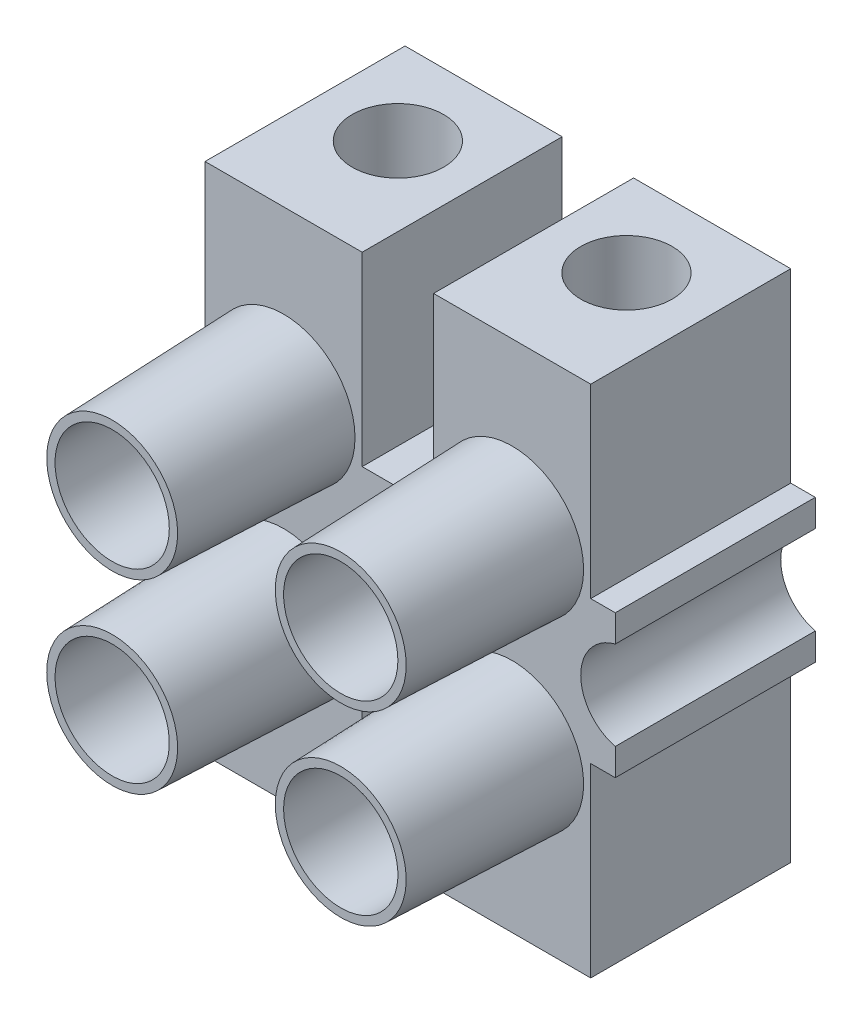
ISO-10303-21;
HEADER;
FILE_DESCRIPTION(('STEP AP214'),'2;1');
FILE_NAME('part.step','',(''),(''),'','','');
FILE_SCHEMA(('AUTOMOTIVE_DESIGN { 1 0 10303 214 1 1 1 1 }'));
ENDSEC;
DATA;
#1=APPLICATION_CONTEXT('core data for automotive mechanical design processes');
#2=APPLICATION_PROTOCOL_DEFINITION('international standard','automotive_design',2000,#1);
#3=PRODUCT_CONTEXT('',#1,'mechanical');
#4=PRODUCT('Part','Part','',(#3));
#5=PRODUCT_RELATED_PRODUCT_CATEGORY('part','',(#4));
#6=PRODUCT_DEFINITION_FORMATION('','',#4);
#7=PRODUCT_DEFINITION_CONTEXT('part definition',#1,'design');
#8=PRODUCT_DEFINITION('design','',#6,#7);
#9=PRODUCT_DEFINITION_SHAPE('','',#8);
#10=(LENGTH_UNIT() NAMED_UNIT(*) SI_UNIT(.MILLI.,.METRE.));
#11=(NAMED_UNIT(*) PLANE_ANGLE_UNIT() SI_UNIT($,.RADIAN.));
#12=(NAMED_UNIT(*) SI_UNIT($,.STERADIAN.) SOLID_ANGLE_UNIT());
#13=UNCERTAINTY_MEASURE_WITH_UNIT(LENGTH_MEASURE(1.E-05),#10,'distance_accuracy_value','');
#14=(GEOMETRIC_REPRESENTATION_CONTEXT(3) GLOBAL_UNCERTAINTY_ASSIGNED_CONTEXT((#13)) GLOBAL_UNIT_ASSIGNED_CONTEXT((#10,
#11,#12)) REPRESENTATION_CONTEXT('',''));
#15=CARTESIAN_POINT('',(0.,0.,0.));
#16=DIRECTION('',(0.,0.,1.));
#17=DIRECTION('',(1.,0.,0.));
#18=AXIS2_PLACEMENT_3D('',#15,#16,#17);
#19=CARTESIAN_POINT('',(14.75,0.,7.));
#20=DIRECTION('',(0.,0.,1.));
#21=DIRECTION('',(1.,0.,0.));
#22=AXIS2_PLACEMENT_3D('',#19,#20,#21);
#23=PLANE('',#22);
#24=DIRECTION('',(0.,-1.,0.));
#25=VECTOR('',#24,1.);
#26=CARTESIAN_POINT('',(0.,2.5,7.));
#27=LINE('',#26,#25);
#28=CARTESIAN_POINT('',(0.,9.,7.));
#29=VERTEX_POINT('',#28);
#30=CARTESIAN_POINT('',(0.,-9.,7.));
#31=VERTEX_POINT('',#30);
#32=EDGE_CURVE('E43',#29,#31,#27,.T.);
#33=ORIENTED_EDGE('',*,*,#32,.T.);
#34=DIRECTION('',(1.,0.,0.));
#35=VECTOR('',#34,1.);
#36=CARTESIAN_POINT('',(0.,-9.,7.));
#37=LINE('',#36,#35);
#38=CARTESIAN_POINT('',(5.5,-9.,7.));
#39=VERTEX_POINT('',#38);
#40=EDGE_CURVE('E169',#31,#39,#37,.T.);
#41=ORIENTED_EDGE('',*,*,#40,.T.);
#42=DIRECTION('',(0.,1.,0.));
#43=VECTOR('',#42,1.);
#44=CARTESIAN_POINT('',(5.5,-9.,7.));
#45=LINE('',#44,#43);
#46=CARTESIAN_POINT('',(5.5,-2.5,7.));
#47=VERTEX_POINT('',#46);
#48=EDGE_CURVE('E217',#39,#47,#45,.T.);
#49=ORIENTED_EDGE('',*,*,#48,.T.);
#50=DIRECTION('',(1.,0.,0.));
#51=VECTOR('',#50,1.);
#52=CARTESIAN_POINT('',(5.5,-2.5,7.));
#53=LINE('',#52,#51);
#54=CARTESIAN_POINT('',(8.,-2.5,7.));
#55=VERTEX_POINT('',#54);
#56=EDGE_CURVE('E219',#47,#55,#53,.T.);
#57=ORIENTED_EDGE('',*,*,#56,.T.);
#58=DIRECTION('',(0.,-1.,0.));
#59=VECTOR('',#58,1.);
#60=CARTESIAN_POINT('',(8.,-2.5,7.));
#61=LINE('',#60,#59);
#62=CARTESIAN_POINT('',(8.,-9.,7.));
#63=VERTEX_POINT('',#62);
#64=EDGE_CURVE('E221',#55,#63,#61,.T.);
#65=ORIENTED_EDGE('',*,*,#64,.T.);
#66=DIRECTION('',(1.,0.,0.));
#67=VECTOR('',#66,1.);
#68=CARTESIAN_POINT('',(8.,-9.,7.));
#69=LINE('',#68,#67);
#70=CARTESIAN_POINT('',(13.5,-9.,7.));
#71=VERTEX_POINT('',#70);
#72=EDGE_CURVE('E223',#63,#71,#69,.T.);
#73=ORIENTED_EDGE('',*,*,#72,.T.);
#74=DIRECTION('',(0.,1.,0.));
#75=VECTOR('',#74,1.);
#76=CARTESIAN_POINT('',(13.5,-9.,7.));
#77=LINE('',#76,#75);
#78=CARTESIAN_POINT('',(13.5,-2.5,7.));
#79=VERTEX_POINT('',#78);
#80=EDGE_CURVE('E225',#71,#79,#77,.T.);
#81=ORIENTED_EDGE('',*,*,#80,.T.);
#82=DIRECTION('',(1.,0.,0.));
#83=VECTOR('',#82,1.);
#84=CARTESIAN_POINT('',(13.5,-2.5,7.));
#85=LINE('',#84,#83);
#86=CARTESIAN_POINT('',(14.3588170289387,-2.5,7.));
#87=VERTEX_POINT('',#86);
#88=EDGE_CURVE('E227',#79,#87,#85,.T.);
#89=ORIENTED_EDGE('',*,*,#88,.T.);
#90=DIRECTION('',(0.,1.,0.));
#91=VECTOR('',#90,1.);
#92=CARTESIAN_POINT('',(14.3588170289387,-1.5514431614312,7.));
#93=LINE('',#92,#91);
#94=CARTESIAN_POINT('',(14.3588170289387,-1.5514431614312,7.));
#95=VERTEX_POINT('',#94);
#96=EDGE_CURVE('E229',#87,#95,#93,.T.);
#97=ORIENTED_EDGE('',*,*,#96,.T.);
#98=CARTESIAN_POINT('',(14.75,0.,7.));
#99=DIRECTION('',(0.,0.,-1.));
#100=DIRECTION('',(1.,0.,0.));
#101=AXIS2_PLACEMENT_3D('',#98,#99,#100);
#102=CIRCLE('',#101,1.6);
#103=CARTESIAN_POINT('',(14.3588170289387,1.5514431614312,7.));
#104=VERTEX_POINT('',#103);
#105=EDGE_CURVE('E231',#95,#104,#102,.T.);
#106=ORIENTED_EDGE('',*,*,#105,.T.);
#107=DIRECTION('',(0.,1.,0.));
#108=VECTOR('',#107,1.);
#109=CARTESIAN_POINT('',(14.3588170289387,2.5,7.));
#110=LINE('',#109,#108);
#111=CARTESIAN_POINT('',(14.3588170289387,2.5,7.));
#112=VERTEX_POINT('',#111);
#113=EDGE_CURVE('E233',#104,#112,#110,.T.);
#114=ORIENTED_EDGE('',*,*,#113,.T.);
#115=DIRECTION('',(-1.,0.,0.));
#116=VECTOR('',#115,1.);
#117=CARTESIAN_POINT('',(13.5,2.5,7.));
#118=LINE('',#117,#116);
#119=CARTESIAN_POINT('',(13.5,2.5,7.));
#120=VERTEX_POINT('',#119);
#121=EDGE_CURVE('E235',#112,#120,#118,.T.);
#122=ORIENTED_EDGE('',*,*,#121,.T.);
#123=DIRECTION('',(0.,1.,0.));
#124=VECTOR('',#123,1.);
#125=CARTESIAN_POINT('',(13.5,9.,7.));
#126=LINE('',#125,#124);
#127=CARTESIAN_POINT('',(13.5,9.,7.));
#128=VERTEX_POINT('',#127);
#129=EDGE_CURVE('E237',#120,#128,#126,.T.);
#130=ORIENTED_EDGE('',*,*,#129,.T.);
#131=DIRECTION('',(-1.,0.,0.));
#132=VECTOR('',#131,1.);
#133=CARTESIAN_POINT('',(8.,9.,7.));
#134=LINE('',#133,#132);
#135=CARTESIAN_POINT('',(8.,9.,7.));
#136=VERTEX_POINT('',#135);
#137=EDGE_CURVE('E239',#128,#136,#134,.T.);
#138=ORIENTED_EDGE('',*,*,#137,.T.);
#139=DIRECTION('',(0.,-1.,0.));
#140=VECTOR('',#139,1.);
#141=CARTESIAN_POINT('',(8.,2.5,7.));
#142=LINE('',#141,#140);
#143=CARTESIAN_POINT('',(8.,2.5,7.));
#144=VERTEX_POINT('',#143);
#145=EDGE_CURVE('E241',#136,#144,#142,.T.);
#146=ORIENTED_EDGE('',*,*,#145,.T.);
#147=DIRECTION('',(-1.,0.,0.));
#148=VECTOR('',#147,1.);
#149=CARTESIAN_POINT('',(5.5,2.5,7.));
#150=LINE('',#149,#148);
#151=CARTESIAN_POINT('',(5.5,2.5,7.));
#152=VERTEX_POINT('',#151);
#153=EDGE_CURVE('E243',#144,#152,#150,.T.);
#154=ORIENTED_EDGE('',*,*,#153,.T.);
#155=DIRECTION('',(0.,1.,0.));
#156=VECTOR('',#155,1.);
#157=CARTESIAN_POINT('',(5.5,9.,7.));
#158=LINE('',#157,#156);
#159=CARTESIAN_POINT('',(5.5,9.,7.));
#160=VERTEX_POINT('',#159);
#161=EDGE_CURVE('E50',#152,#160,#158,.T.);
#162=ORIENTED_EDGE('',*,*,#161,.T.);
#163=DIRECTION('',(-1.,0.,0.));
#164=VECTOR('',#163,1.);
#165=CARTESIAN_POINT('',(0.,9.,7.));
#166=LINE('',#165,#164);
#167=EDGE_CURVE('E246',#160,#29,#166,.T.);
#168=ORIENTED_EDGE('',*,*,#167,.T.);
#169=EDGE_LOOP('',(#33,#41,#49,#57,#65,#73,#81,#89,#97,#106,#114,#122,#130,#138,#146,#154,#162,#168));
#170=FACE_BOUND('',#169,.T.);
#171=CARTESIAN_POINT('',(6.75,0.,7.));
#172=DIRECTION('',(0.,0.,1.));
#173=DIRECTION('',(1.,0.,0.));
#174=AXIS2_PLACEMENT_3D('',#171,#172,#173);
#175=CIRCLE('',#174,1.6);
#176=CARTESIAN_POINT('',(8.35,0.,7.));
#177=VERTEX_POINT('',#176);
#178=EDGE_CURVE('E178',#177,#177,#175,.T.);
#179=ORIENTED_EDGE('',*,*,#178,.F.);
#180=EDGE_LOOP('',(#179));
#181=FACE_BOUND('',#180,.T.);
#182=CARTESIAN_POINT('',(2.75,3.25,7.));
#183=DIRECTION('',(0.,0.,1.));
#184=DIRECTION('',(1.,0.,0.));
#185=AXIS2_PLACEMENT_3D('',#182,#183,#184);
#186=CIRCLE('',#185,2.5);
#187=CARTESIAN_POINT('',(5.25,3.25,7.));
#188=VERTEX_POINT('',#187);
#189=EDGE_CURVE('E305',#188,#188,#186,.T.);
#190=ORIENTED_EDGE('',*,*,#189,.F.);
#191=EDGE_LOOP('',(#190));
#192=FACE_BOUND('',#191,.T.);
#193=CARTESIAN_POINT('',(10.75,3.25,7.));
#194=DIRECTION('',(0.,0.,1.));
#195=DIRECTION('',(1.,0.,0.));
#196=AXIS2_PLACEMENT_3D('',#193,#194,#195);
#197=CIRCLE('',#196,2.5);
#198=CARTESIAN_POINT('',(13.25,3.25,7.));
#199=VERTEX_POINT('',#198);
#200=EDGE_CURVE('E313',#199,#199,#197,.T.);
#201=ORIENTED_EDGE('',*,*,#200,.F.);
#202=EDGE_LOOP('',(#201));
#203=FACE_BOUND('',#202,.T.);
#204=CARTESIAN_POINT('',(10.75,-3.25,7.));
#205=DIRECTION('',(0.,0.,1.));
#206=DIRECTION('',(-1.,0.,0.));
#207=AXIS2_PLACEMENT_3D('',#204,#205,#206);
#208=CIRCLE('',#207,2.5);
#209=CARTESIAN_POINT('',(8.25,-3.25,7.));
#210=VERTEX_POINT('',#209);
#211=EDGE_CURVE('E309',#210,#210,#208,.T.);
#212=ORIENTED_EDGE('',*,*,#211,.F.);
#213=EDGE_LOOP('',(#212));
#214=FACE_BOUND('',#213,.T.);
#215=CARTESIAN_POINT('',(2.75,-3.25,7.));
#216=DIRECTION('',(0.,0.,1.));
#217=DIRECTION('',(-1.,0.,0.));
#218=AXIS2_PLACEMENT_3D('',#215,#216,#217);
#219=CIRCLE('',#218,2.5);
#220=CARTESIAN_POINT('',(0.249999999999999,-3.25,7.));
#221=VERTEX_POINT('',#220);
#222=EDGE_CURVE('E437',#221,#221,#219,.T.);
#223=ORIENTED_EDGE('',*,*,#222,.F.);
#224=EDGE_LOOP('',(#223));
#225=FACE_BOUND('',#224,.T.);
#226=ADVANCED_FACE('F26',(#170,#181,#192,#203,#214,#225),#23,.T.);
#227=CARTESIAN_POINT('',(14.75,0.,0.));
#228=DIRECTION('',(0.,0.,1.));
#229=DIRECTION('',(1.,0.,0.));
#230=AXIS2_PLACEMENT_3D('',#227,#228,#229);
#231=PLANE('',#230);
#232=DIRECTION('',(1.,0.,0.));
#233=VECTOR('',#232,1.);
#234=CARTESIAN_POINT('',(0.,-9.,0.));
#235=LINE('',#234,#233);
#236=CARTESIAN_POINT('',(0.,-9.,0.));
#237=VERTEX_POINT('',#236);
#238=CARTESIAN_POINT('',(5.5,-9.,0.));
#239=VERTEX_POINT('',#238);
#240=EDGE_CURVE('E167',#237,#239,#235,.T.);
#241=ORIENTED_EDGE('',*,*,#240,.F.);
#242=DIRECTION('',(0.,-1.,0.));
#243=VECTOR('',#242,1.);
#244=CARTESIAN_POINT('',(0.,2.5,0.));
#245=LINE('',#244,#243);
#246=CARTESIAN_POINT('',(0.,9.,0.));
#247=VERTEX_POINT('',#246);
#248=EDGE_CURVE('E152',#247,#237,#245,.T.);
#249=ORIENTED_EDGE('',*,*,#248,.F.);
#250=DIRECTION('',(-1.,0.,0.));
#251=VECTOR('',#250,1.);
#252=CARTESIAN_POINT('',(0.,9.,0.));
#253=LINE('',#252,#251);
#254=CARTESIAN_POINT('',(5.5,9.,0.));
#255=VERTEX_POINT('',#254);
#256=EDGE_CURVE('E162',#255,#247,#253,.T.);
#257=ORIENTED_EDGE('',*,*,#256,.F.);
#258=DIRECTION('',(0.,1.,0.));
#259=VECTOR('',#258,1.);
#260=CARTESIAN_POINT('',(5.5,9.,0.));
#261=LINE('',#260,#259);
#262=CARTESIAN_POINT('',(5.5,2.5,0.));
#263=VERTEX_POINT('',#262);
#264=EDGE_CURVE('E212',#263,#255,#261,.T.);
#265=ORIENTED_EDGE('',*,*,#264,.F.);
#266=DIRECTION('',(-1.,0.,0.));
#267=VECTOR('',#266,1.);
#268=CARTESIAN_POINT('',(5.5,2.5,0.));
#269=LINE('',#268,#267);
#270=CARTESIAN_POINT('',(8.,2.5,0.));
#271=VERTEX_POINT('',#270);
#272=EDGE_CURVE('E210',#271,#263,#269,.T.);
#273=ORIENTED_EDGE('',*,*,#272,.F.);
#274=DIRECTION('',(0.,-1.,0.));
#275=VECTOR('',#274,1.);
#276=CARTESIAN_POINT('',(8.,2.5,0.));
#277=LINE('',#276,#275);
#278=CARTESIAN_POINT('',(8.,9.,0.));
#279=VERTEX_POINT('',#278);
#280=EDGE_CURVE('E208',#279,#271,#277,.T.);
#281=ORIENTED_EDGE('',*,*,#280,.F.);
#282=DIRECTION('',(-1.,0.,0.));
#283=VECTOR('',#282,1.);
#284=CARTESIAN_POINT('',(8.,9.,0.));
#285=LINE('',#284,#283);
#286=CARTESIAN_POINT('',(13.5,9.,0.));
#287=VERTEX_POINT('',#286);
#288=EDGE_CURVE('E206',#287,#279,#285,.T.);
#289=ORIENTED_EDGE('',*,*,#288,.F.);
#290=DIRECTION('',(0.,1.,0.));
#291=VECTOR('',#290,1.);
#292=CARTESIAN_POINT('',(13.5,9.,0.));
#293=LINE('',#292,#291);
#294=CARTESIAN_POINT('',(13.5,2.5,0.));
#295=VERTEX_POINT('',#294);
#296=EDGE_CURVE('E204',#295,#287,#293,.T.);
#297=ORIENTED_EDGE('',*,*,#296,.F.);
#298=DIRECTION('',(-1.,0.,0.));
#299=VECTOR('',#298,1.);
#300=CARTESIAN_POINT('',(13.5,2.5,0.));
#301=LINE('',#300,#299);
#302=CARTESIAN_POINT('',(14.3588170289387,2.5,0.));
#303=VERTEX_POINT('',#302);
#304=EDGE_CURVE('E202',#303,#295,#301,.T.);
#305=ORIENTED_EDGE('',*,*,#304,.F.);
#306=DIRECTION('',(0.,1.,0.));
#307=VECTOR('',#306,1.);
#308=CARTESIAN_POINT('',(14.3588170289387,2.5,0.));
#309=LINE('',#308,#307);
#310=CARTESIAN_POINT('',(14.3588170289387,1.5514431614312,0.));
#311=VERTEX_POINT('',#310);
#312=EDGE_CURVE('E200',#311,#303,#309,.T.);
#313=ORIENTED_EDGE('',*,*,#312,.F.);
#314=CARTESIAN_POINT('',(14.75,0.,0.));
#315=DIRECTION('',(0.,0.,-1.));
#316=DIRECTION('',(1.,0.,0.));
#317=AXIS2_PLACEMENT_3D('',#314,#315,#316);
#318=CIRCLE('',#317,1.6);
#319=CARTESIAN_POINT('',(14.3588170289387,-1.5514431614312,0.));
#320=VERTEX_POINT('',#319);
#321=EDGE_CURVE('E198',#320,#311,#318,.T.);
#322=ORIENTED_EDGE('',*,*,#321,.F.);
#323=DIRECTION('',(0.,1.,0.));
#324=VECTOR('',#323,1.);
#325=CARTESIAN_POINT('',(14.3588170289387,-1.5514431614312,0.));
#326=LINE('',#325,#324);
#327=CARTESIAN_POINT('',(14.3588170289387,-2.5,0.));
#328=VERTEX_POINT('',#327);
#329=EDGE_CURVE('E196',#328,#320,#326,.T.);
#330=ORIENTED_EDGE('',*,*,#329,.F.);
#331=DIRECTION('',(1.,0.,0.));
#332=VECTOR('',#331,1.);
#333=CARTESIAN_POINT('',(13.5,-2.5,0.));
#334=LINE('',#333,#332);
#335=CARTESIAN_POINT('',(13.5,-2.5,0.));
#336=VERTEX_POINT('',#335);
#337=EDGE_CURVE('E194',#336,#328,#334,.T.);
#338=ORIENTED_EDGE('',*,*,#337,.F.);
#339=DIRECTION('',(0.,1.,0.));
#340=VECTOR('',#339,1.);
#341=CARTESIAN_POINT('',(13.5,-9.,0.));
#342=LINE('',#341,#340);
#343=CARTESIAN_POINT('',(13.5,-9.,0.));
#344=VERTEX_POINT('',#343);
#345=EDGE_CURVE('E192',#344,#336,#342,.T.);
#346=ORIENTED_EDGE('',*,*,#345,.F.);
#347=DIRECTION('',(1.,0.,0.));
#348=VECTOR('',#347,1.);
#349=CARTESIAN_POINT('',(8.,-9.,0.));
#350=LINE('',#349,#348);
#351=CARTESIAN_POINT('',(8.,-9.,0.));
#352=VERTEX_POINT('',#351);
#353=EDGE_CURVE('E190',#352,#344,#350,.T.);
#354=ORIENTED_EDGE('',*,*,#353,.F.);
#355=DIRECTION('',(0.,-1.,0.));
#356=VECTOR('',#355,1.);
#357=CARTESIAN_POINT('',(8.,-2.5,0.));
#358=LINE('',#357,#356);
#359=CARTESIAN_POINT('',(8.,-2.5,0.));
#360=VERTEX_POINT('',#359);
#361=EDGE_CURVE('E188',#360,#352,#358,.T.);
#362=ORIENTED_EDGE('',*,*,#361,.F.);
#363=DIRECTION('',(1.,0.,0.));
#364=VECTOR('',#363,1.);
#365=CARTESIAN_POINT('',(5.5,-2.5,0.));
#366=LINE('',#365,#364);
#367=CARTESIAN_POINT('',(5.5,-2.5,0.));
#368=VERTEX_POINT('',#367);
#369=EDGE_CURVE('E180',#368,#360,#366,.T.);
#370=ORIENTED_EDGE('',*,*,#369,.F.);
#371=DIRECTION('',(0.,1.,0.));
#372=VECTOR('',#371,1.);
#373=CARTESIAN_POINT('',(5.5,-9.,0.));
#374=LINE('',#373,#372);
#375=EDGE_CURVE('E177',#239,#368,#374,.T.);
#376=ORIENTED_EDGE('',*,*,#375,.F.);
#377=EDGE_LOOP('',(#241,#249,#257,#265,#273,#281,#289,#297,#305,#313,#322,#330,#338,#346,#354,
#362,#370,#376));
#378=FACE_BOUND('',#377,.T.);
#379=CARTESIAN_POINT('',(6.75,0.,0.));
#380=DIRECTION('',(0.,0.,1.));
#381=DIRECTION('',(1.,0.,0.));
#382=AXIS2_PLACEMENT_3D('',#379,#380,#381);
#383=CIRCLE('',#382,1.6);
#384=CARTESIAN_POINT('',(8.35,0.,0.));
#385=VERTEX_POINT('',#384);
#386=EDGE_CURVE('E183',#385,#385,#383,.T.);
#387=ORIENTED_EDGE('',*,*,#386,.T.);
#388=EDGE_LOOP('',(#387));
#389=FACE_BOUND('',#388,.T.);
#390=ADVANCED_FACE('F174',(#378,#389),#231,.F.);
#391=CARTESIAN_POINT('',(0.,-9.,7.));
#392=DIRECTION('',(0.,1.,0.));
#393=DIRECTION('',(0.,0.,1.));
#394=AXIS2_PLACEMENT_3D('',#391,#392,#393);
#395=PLANE('',#394);
#396=CARTESIAN_POINT('',(2.75,-9.,3.));
#397=DIRECTION('',(0.,-1.,0.));
#398=DIRECTION('',(0.,0.,-1.));
#399=AXIS2_PLACEMENT_3D('',#396,#397,#398);
#400=CIRCLE('',#399,1.6);
#401=CARTESIAN_POINT('',(2.75,-9.,1.4));
#402=VERTEX_POINT('',#401);
#403=EDGE_CURVE('E426',#402,#402,#400,.T.);
#404=ORIENTED_EDGE('',*,*,#403,.F.);
#405=EDGE_LOOP('',(#404));
#406=FACE_BOUND('',#405,.T.);
#407=ORIENTED_EDGE('',*,*,#240,.T.);
#408=DIRECTION('',(0.,0.,-1.));
#409=VECTOR('',#408,1.);
#410=CARTESIAN_POINT('',(5.5,-9.,7.));
#411=LINE('',#410,#409);
#412=EDGE_CURVE('E171',#39,#239,#411,.T.);
#413=ORIENTED_EDGE('',*,*,#412,.F.);
#414=ORIENTED_EDGE('',*,*,#40,.F.);
#415=DIRECTION('',(0.,0.,-1.));
#416=VECTOR('',#415,1.);
#417=CARTESIAN_POINT('',(0.,-9.,7.));
#418=LINE('',#417,#416);
#419=EDGE_CURVE('E155',#31,#237,#418,.T.);
#420=ORIENTED_EDGE('',*,*,#419,.T.);
#421=EDGE_LOOP('',(#407,#413,#414,#420));
#422=FACE_BOUND('',#421,.T.);
#423=ADVANCED_FACE('F165',(#406,#422),#395,.F.);
#424=CARTESIAN_POINT('',(5.5,-9.,7.));
#425=DIRECTION('',(-1.,0.,0.));
#426=DIRECTION('',(0.,0.,1.));
#427=AXIS2_PLACEMENT_3D('',#424,#425,#426);
#428=PLANE('',#427);
#429=ORIENTED_EDGE('',*,*,#375,.T.);
#430=DIRECTION('',(0.,0.,-1.));
#431=VECTOR('',#430,1.);
#432=CARTESIAN_POINT('',(5.5,-2.5,7.));
#433=LINE('',#432,#431);
#434=EDGE_CURVE('E291',#47,#368,#433,.T.);
#435=ORIENTED_EDGE('',*,*,#434,.F.);
#436=ORIENTED_EDGE('',*,*,#48,.F.);
#437=ORIENTED_EDGE('',*,*,#412,.T.);
#438=EDGE_LOOP('',(#429,#435,#436,#437));
#439=FACE_BOUND('',#438,.T.);
#440=ADVANCED_FACE('F528',(#439),#428,.F.);
#441=CARTESIAN_POINT('',(5.5,-2.5,7.));
#442=DIRECTION('',(0.,1.,0.));
#443=DIRECTION('',(-1.,0.,0.));
#444=AXIS2_PLACEMENT_3D('',#441,#442,#443);
#445=PLANE('',#444);
#446=ORIENTED_EDGE('',*,*,#369,.T.);
#447=DIRECTION('',(0.,0.,-1.));
#448=VECTOR('',#447,1.);
#449=CARTESIAN_POINT('',(8.,-2.5,7.));
#450=LINE('',#449,#448);
#451=EDGE_CURVE('E288',#55,#360,#450,.T.);
#452=ORIENTED_EDGE('',*,*,#451,.F.);
#453=ORIENTED_EDGE('',*,*,#56,.F.);
#454=ORIENTED_EDGE('',*,*,#434,.T.);
#455=EDGE_LOOP('',(#446,#452,#453,#454));
#456=FACE_BOUND('',#455,.T.);
#457=ADVANCED_FACE('F651',(#456),#445,.F.);
#458=CARTESIAN_POINT('',(8.,-2.5,7.));
#459=DIRECTION('',(1.,0.,0.));
#460=DIRECTION('',(0.,0.,-1.));
#461=AXIS2_PLACEMENT_3D('',#458,#459,#460);
#462=PLANE('',#461);
#463=ORIENTED_EDGE('',*,*,#361,.T.);
#464=DIRECTION('',(0.,0.,-1.));
#465=VECTOR('',#464,1.);
#466=CARTESIAN_POINT('',(8.,-9.,7.));
#467=LINE('',#466,#465);
#468=EDGE_CURVE('E285',#63,#352,#467,.T.);
#469=ORIENTED_EDGE('',*,*,#468,.F.);
#470=ORIENTED_EDGE('',*,*,#64,.F.);
#471=ORIENTED_EDGE('',*,*,#451,.T.);
#472=EDGE_LOOP('',(#463,#469,#470,#471));
#473=FACE_BOUND('',#472,.T.);
#474=ADVANCED_FACE('F520',(#473),#462,.F.);
#475=CARTESIAN_POINT('',(8.,-9.,7.));
#476=DIRECTION('',(0.,1.,0.));
#477=DIRECTION('',(0.,0.,1.));
#478=AXIS2_PLACEMENT_3D('',#475,#476,#477);
#479=PLANE('',#478);
#480=CARTESIAN_POINT('',(10.75,-9.,3.));
#481=DIRECTION('',(0.,-1.,0.));
#482=DIRECTION('',(0.,0.,-1.));
#483=AXIS2_PLACEMENT_3D('',#480,#481,#482);
#484=CIRCLE('',#483,1.6);
#485=CARTESIAN_POINT('',(10.75,-9.,1.4));
#486=VERTEX_POINT('',#485);
#487=EDGE_CURVE('E423',#486,#486,#484,.T.);
#488=ORIENTED_EDGE('',*,*,#487,.F.);
#489=EDGE_LOOP('',(#488));
#490=FACE_BOUND('',#489,.T.);
#491=ORIENTED_EDGE('',*,*,#353,.T.);
#492=DIRECTION('',(0.,0.,-1.));
#493=VECTOR('',#492,1.);
#494=CARTESIAN_POINT('',(13.5,-9.,7.));
#495=LINE('',#494,#493);
#496=EDGE_CURVE('E282',#71,#344,#495,.T.);
#497=ORIENTED_EDGE('',*,*,#496,.F.);
#498=ORIENTED_EDGE('',*,*,#72,.F.);
#499=ORIENTED_EDGE('',*,*,#468,.T.);
#500=EDGE_LOOP('',(#491,#497,#498,#499));
#501=FACE_BOUND('',#500,.T.);
#502=ADVANCED_FACE('F515',(#490,#501),#479,.F.);
#503=CARTESIAN_POINT('',(13.5,-9.,7.));
#504=DIRECTION('',(-1.,0.,0.));
#505=DIRECTION('',(0.,0.,1.));
#506=AXIS2_PLACEMENT_3D('',#503,#504,#505);
#507=PLANE('',#506);
#508=ORIENTED_EDGE('',*,*,#345,.T.);
#509=DIRECTION('',(0.,0.,-1.));
#510=VECTOR('',#509,1.);
#511=CARTESIAN_POINT('',(13.5,-2.5,7.));
#512=LINE('',#511,#510);
#513=EDGE_CURVE('E279',#79,#336,#512,.T.);
#514=ORIENTED_EDGE('',*,*,#513,.F.);
#515=ORIENTED_EDGE('',*,*,#80,.F.);
#516=ORIENTED_EDGE('',*,*,#496,.T.);
#517=EDGE_LOOP('',(#508,#514,#515,#516));
#518=FACE_BOUND('',#517,.T.);
#519=ADVANCED_FACE('F519',(#518),#507,.F.);
#520=CARTESIAN_POINT('',(13.5,-2.5,7.));
#521=DIRECTION('',(0.,1.,0.));
#522=DIRECTION('',(0.,0.,1.));
#523=AXIS2_PLACEMENT_3D('',#520,#521,#522);
#524=PLANE('',#523);
#525=ORIENTED_EDGE('',*,*,#337,.T.);
#526=DIRECTION('',(0.,0.,-1.));
#527=VECTOR('',#526,1.);
#528=CARTESIAN_POINT('',(14.3588170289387,-2.5,7.));
#529=LINE('',#528,#527);
#530=EDGE_CURVE('E276',#87,#328,#529,.T.);
#531=ORIENTED_EDGE('',*,*,#530,.F.);
#532=ORIENTED_EDGE('',*,*,#88,.F.);
#533=ORIENTED_EDGE('',*,*,#513,.T.);
#534=EDGE_LOOP('',(#525,#531,#532,#533));
#535=FACE_BOUND('',#534,.T.);
#536=ADVANCED_FACE('F631',(#535),#524,.F.);
#537=CARTESIAN_POINT('',(14.3588170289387,-1.5514431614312,7.));
#538=DIRECTION('',(-1.,0.,0.));
#539=DIRECTION('',(0.,0.,1.));
#540=AXIS2_PLACEMENT_3D('',#537,#538,#539);
#541=PLANE('',#540);
#542=ORIENTED_EDGE('',*,*,#329,.T.);
#543=DIRECTION('',(0.,0.,-1.));
#544=VECTOR('',#543,1.);
#545=CARTESIAN_POINT('',(14.3588170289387,-1.5514431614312,7.));
#546=LINE('',#545,#544);
#547=EDGE_CURVE('E273',#95,#320,#546,.T.);
#548=ORIENTED_EDGE('',*,*,#547,.F.);
#549=ORIENTED_EDGE('',*,*,#96,.F.);
#550=ORIENTED_EDGE('',*,*,#530,.T.);
#551=EDGE_LOOP('',(#542,#548,#549,#550));
#552=FACE_BOUND('',#551,.T.);
#553=ADVANCED_FACE('F623',(#552),#541,.F.);
#554=CARTESIAN_POINT('',(14.75,0.,7.));
#555=DIRECTION('',(0.,0.,-1.));
#556=DIRECTION('',(-1.,0.,0.));
#557=AXIS2_PLACEMENT_3D('',#554,#555,#556);
#558=CYLINDRICAL_SURFACE('',#557,1.6);
#559=ORIENTED_EDGE('',*,*,#321,.T.);
#560=DIRECTION('',(0.,0.,-1.));
#561=VECTOR('',#560,1.);
#562=CARTESIAN_POINT('',(14.3588170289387,1.5514431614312,7.));
#563=LINE('',#562,#561);
#564=EDGE_CURVE('E270',#104,#311,#563,.T.);
#565=ORIENTED_EDGE('',*,*,#564,.F.);
#566=ORIENTED_EDGE('',*,*,#105,.F.);
#567=ORIENTED_EDGE('',*,*,#547,.T.);
#568=EDGE_LOOP('',(#559,#565,#566,#567));
#569=FACE_BOUND('',#568,.T.);
#570=ADVANCED_FACE('F615',(#569),#558,.F.);
#571=CARTESIAN_POINT('',(14.3588170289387,2.5,7.));
#572=DIRECTION('',(-1.,0.,0.));
#573=DIRECTION('',(0.,0.,1.));
#574=AXIS2_PLACEMENT_3D('',#571,#572,#573);
#575=PLANE('',#574);
#576=ORIENTED_EDGE('',*,*,#312,.T.);
#577=DIRECTION('',(0.,0.,-1.));
#578=VECTOR('',#577,1.);
#579=CARTESIAN_POINT('',(14.3588170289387,2.5,7.));
#580=LINE('',#579,#578);
#581=EDGE_CURVE('E267',#112,#303,#580,.T.);
#582=ORIENTED_EDGE('',*,*,#581,.F.);
#583=ORIENTED_EDGE('',*,*,#113,.F.);
#584=ORIENTED_EDGE('',*,*,#564,.T.);
#585=EDGE_LOOP('',(#576,#582,#583,#584));
#586=FACE_BOUND('',#585,.T.);
#587=ADVANCED_FACE('F607',(#586),#575,.F.);
#588=CARTESIAN_POINT('',(13.5,2.5,7.));
#589=DIRECTION('',(0.,-1.,0.));
#590=DIRECTION('',(1.,0.,0.));
#591=AXIS2_PLACEMENT_3D('',#588,#589,#590);
#592=PLANE('',#591);
#593=ORIENTED_EDGE('',*,*,#304,.T.);
#594=DIRECTION('',(0.,0.,-1.));
#595=VECTOR('',#594,1.);
#596=CARTESIAN_POINT('',(13.5,2.5,7.));
#597=LINE('',#596,#595);
#598=EDGE_CURVE('E264',#120,#295,#597,.T.);
#599=ORIENTED_EDGE('',*,*,#598,.F.);
#600=ORIENTED_EDGE('',*,*,#121,.F.);
#601=ORIENTED_EDGE('',*,*,#581,.T.);
#602=EDGE_LOOP('',(#593,#599,#600,#601));
#603=FACE_BOUND('',#602,.T.);
#604=ADVANCED_FACE('F599',(#603),#592,.F.);
#605=CARTESIAN_POINT('',(13.5,9.,7.));
#606=DIRECTION('',(-1.,0.,0.));
#607=DIRECTION('',(0.,0.,1.));
#608=AXIS2_PLACEMENT_3D('',#605,#606,#607);
#609=PLANE('',#608);
#610=ORIENTED_EDGE('',*,*,#296,.T.);
#611=DIRECTION('',(0.,0.,-1.));
#612=VECTOR('',#611,1.);
#613=CARTESIAN_POINT('',(13.5,9.,7.));
#614=LINE('',#613,#612);
#615=EDGE_CURVE('E261',#128,#287,#614,.T.);
#616=ORIENTED_EDGE('',*,*,#615,.F.);
#617=ORIENTED_EDGE('',*,*,#129,.F.);
#618=ORIENTED_EDGE('',*,*,#598,.T.);
#619=EDGE_LOOP('',(#610,#616,#617,#618));
#620=FACE_BOUND('',#619,.T.);
#621=ADVANCED_FACE('F508',(#620),#609,.F.);
#622=CARTESIAN_POINT('',(8.,9.,7.));
#623=DIRECTION('',(0.,-1.,0.));
#624=DIRECTION('',(0.,0.,-1.));
#625=AXIS2_PLACEMENT_3D('',#622,#623,#624);
#626=PLANE('',#625);
#627=CARTESIAN_POINT('',(10.75,9.,3.));
#628=DIRECTION('',(0.,-1.,0.));
#629=DIRECTION('',(0.,0.,-1.));
#630=AXIS2_PLACEMENT_3D('',#627,#628,#629);
#631=CIRCLE('',#630,1.6);
#632=CARTESIAN_POINT('',(10.75,9.,1.4));
#633=VERTEX_POINT('',#632);
#634=EDGE_CURVE('E420',#633,#633,#631,.T.);
#635=ORIENTED_EDGE('',*,*,#634,.T.);
#636=EDGE_LOOP('',(#635));
#637=FACE_BOUND('',#636,.T.);
#638=ORIENTED_EDGE('',*,*,#288,.T.);
#639=DIRECTION('',(0.,0.,-1.));
#640=VECTOR('',#639,1.);
#641=CARTESIAN_POINT('',(8.,9.,7.));
#642=LINE('',#641,#640);
#643=EDGE_CURVE('E258',#136,#279,#642,.T.);
#644=ORIENTED_EDGE('',*,*,#643,.F.);
#645=ORIENTED_EDGE('',*,*,#137,.F.);
#646=ORIENTED_EDGE('',*,*,#615,.T.);
#647=EDGE_LOOP('',(#638,#644,#645,#646));
#648=FACE_BOUND('',#647,.T.);
#649=ADVANCED_FACE('F503',(#637,#648),#626,.F.);
#650=CARTESIAN_POINT('',(8.,2.5,7.));
#651=DIRECTION('',(1.,0.,0.));
#652=DIRECTION('',(0.,0.,-1.));
#653=AXIS2_PLACEMENT_3D('',#650,#651,#652);
#654=PLANE('',#653);
#655=ORIENTED_EDGE('',*,*,#280,.T.);
#656=DIRECTION('',(0.,0.,-1.));
#657=VECTOR('',#656,1.);
#658=CARTESIAN_POINT('',(8.,2.5,7.));
#659=LINE('',#658,#657);
#660=EDGE_CURVE('E255',#144,#271,#659,.T.);
#661=ORIENTED_EDGE('',*,*,#660,.F.);
#662=ORIENTED_EDGE('',*,*,#145,.F.);
#663=ORIENTED_EDGE('',*,*,#643,.T.);
#664=EDGE_LOOP('',(#655,#661,#662,#663));
#665=FACE_BOUND('',#664,.T.);
#666=ADVANCED_FACE('F507',(#665),#654,.F.);
#667=CARTESIAN_POINT('',(5.5,2.5,7.));
#668=DIRECTION('',(0.,-1.,0.));
#669=DIRECTION('',(1.,0.,0.));
#670=AXIS2_PLACEMENT_3D('',#667,#668,#669);
#671=PLANE('',#670);
#672=ORIENTED_EDGE('',*,*,#272,.T.);
#673=DIRECTION('',(0.,0.,-1.));
#674=VECTOR('',#673,1.);
#675=CARTESIAN_POINT('',(5.5,2.5,7.));
#676=LINE('',#675,#674);
#677=EDGE_CURVE('E252',#152,#263,#676,.T.);
#678=ORIENTED_EDGE('',*,*,#677,.F.);
#679=ORIENTED_EDGE('',*,*,#153,.F.);
#680=ORIENTED_EDGE('',*,*,#660,.T.);
#681=EDGE_LOOP('',(#672,#678,#679,#680));
#682=FACE_BOUND('',#681,.T.);
#683=ADVANCED_FACE('F579',(#682),#671,.F.);
#684=CARTESIAN_POINT('',(5.5,9.,7.));
#685=DIRECTION('',(-1.,0.,0.));
#686=DIRECTION('',(0.,0.,1.));
#687=AXIS2_PLACEMENT_3D('',#684,#685,#686);
#688=PLANE('',#687);
#689=ORIENTED_EDGE('',*,*,#264,.T.);
#690=DIRECTION('',(0.,0.,-1.));
#691=VECTOR('',#690,1.);
#692=CARTESIAN_POINT('',(5.5,9.,7.));
#693=LINE('',#692,#691);
#694=EDGE_CURVE('E249',#160,#255,#693,.T.);
#695=ORIENTED_EDGE('',*,*,#694,.F.);
#696=ORIENTED_EDGE('',*,*,#161,.F.);
#697=ORIENTED_EDGE('',*,*,#677,.T.);
#698=EDGE_LOOP('',(#689,#695,#696,#697));
#699=FACE_BOUND('',#698,.T.);
#700=ADVANCED_FACE('F496',(#699),#688,.F.);
#701=CARTESIAN_POINT('',(0.,9.,7.));
#702=DIRECTION('',(0.,-1.,0.));
#703=DIRECTION('',(0.,0.,-1.));
#704=AXIS2_PLACEMENT_3D('',#701,#702,#703);
#705=PLANE('',#704);
#706=CARTESIAN_POINT('',(2.75,9.,3.));
#707=DIRECTION('',(0.,-1.,0.));
#708=DIRECTION('',(0.,0.,-1.));
#709=AXIS2_PLACEMENT_3D('',#706,#707,#708);
#710=CIRCLE('',#709,1.6);
#711=CARTESIAN_POINT('',(2.75,9.,1.4));
#712=VERTEX_POINT('',#711);
#713=EDGE_CURVE('E431',#712,#712,#710,.T.);
#714=ORIENTED_EDGE('',*,*,#713,.T.);
#715=EDGE_LOOP('',(#714));
#716=FACE_BOUND('',#715,.T.);
#717=ORIENTED_EDGE('',*,*,#256,.T.);
#718=DIRECTION('',(0.,0.,-1.));
#719=VECTOR('',#718,1.);
#720=CARTESIAN_POINT('',(0.,9.,7.));
#721=LINE('',#720,#719);
#722=EDGE_CURVE('E158',#29,#247,#721,.T.);
#723=ORIENTED_EDGE('',*,*,#722,.F.);
#724=ORIENTED_EDGE('',*,*,#167,.F.);
#725=ORIENTED_EDGE('',*,*,#694,.T.);
#726=EDGE_LOOP('',(#717,#723,#724,#725));
#727=FACE_BOUND('',#726,.T.);
#728=ADVANCED_FACE('F343',(#716,#727),#705,.F.);
#729=CARTESIAN_POINT('',(0.,2.5,7.));
#730=DIRECTION('',(1.,0.,0.));
#731=DIRECTION('',(0.,0.,-1.));
#732=AXIS2_PLACEMENT_3D('',#729,#730,#731);
#733=PLANE('',#732);
#734=ORIENTED_EDGE('',*,*,#248,.T.);
#735=ORIENTED_EDGE('',*,*,#419,.F.);
#736=ORIENTED_EDGE('',*,*,#32,.F.);
#737=ORIENTED_EDGE('',*,*,#722,.T.);
#738=EDGE_LOOP('',(#734,#735,#736,#737));
#739=FACE_BOUND('',#738,.T.);
#740=ADVANCED_FACE('F154',(#739),#733,.F.);
#741=CARTESIAN_POINT('',(6.75,0.,7.));
#742=DIRECTION('',(0.,0.,-1.));
#743=DIRECTION('',(-1.,0.,0.));
#744=AXIS2_PLACEMENT_3D('',#741,#742,#743);
#745=CYLINDRICAL_SURFACE('',#744,1.6);
#746=ORIENTED_EDGE('',*,*,#178,.T.);
#747=EDGE_LOOP('',(#746));
#748=FACE_BOUND('',#747,.T.);
#749=ORIENTED_EDGE('',*,*,#386,.F.);
#750=EDGE_LOOP('',(#749));
#751=FACE_BOUND('',#750,.T.);
#752=ADVANCED_FACE('F330',(#748,#751),#745,.F.);
#753=CARTESIAN_POINT('',(2.75,3.25,13.));
#754=DIRECTION('',(0.,0.,1.));
#755=DIRECTION('',(1.,0.,0.));
#756=AXIS2_PLACEMENT_3D('',#753,#754,#755);
#757=PLANE('',#756);
#758=CARTESIAN_POINT('',(2.75,3.25,13.));
#759=DIRECTION('',(0.,0.,1.));
#760=DIRECTION('',(1.,0.,0.));
#761=AXIS2_PLACEMENT_3D('',#758,#759,#760);
#762=CIRCLE('',#761,2.29047538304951);
#763=CARTESIAN_POINT('',(5.04047538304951,3.25,13.));
#764=VERTEX_POINT('',#763);
#765=EDGE_CURVE('E302',#764,#764,#762,.T.);
#766=ORIENTED_EDGE('',*,*,#765,.T.);
#767=EDGE_LOOP('',(#766));
#768=FACE_BOUND('',#767,.T.);
#769=CARTESIAN_POINT('',(2.75,3.25,13.));
#770=DIRECTION('',(0.,0.,1.));
#771=DIRECTION('',(1.,0.,0.));
#772=AXIS2_PLACEMENT_3D('',#769,#770,#771);
#773=CIRCLE('',#772,2.);
#774=CARTESIAN_POINT('',(4.75,3.25,13.));
#775=VERTEX_POINT('',#774);
#776=EDGE_CURVE('E312',#775,#775,#773,.T.);
#777=ORIENTED_EDGE('',*,*,#776,.F.);
#778=EDGE_LOOP('',(#777));
#779=FACE_BOUND('',#778,.T.);
#780=ADVANCED_FACE('F332',(#768,#779),#757,.T.);
#781=CARTESIAN_POINT('',(2.75,3.25,7.));
#782=DIRECTION('',(0.,0.,-1.));
#783=DIRECTION('',(1.,0.,0.));
#784=AXIS2_PLACEMENT_3D('',#781,#782,#783);
#785=CONICAL_SURFACE('',#784,2.5,0.0349065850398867);
#786=ORIENTED_EDGE('',*,*,#765,.F.);
#787=EDGE_LOOP('',(#786));
#788=FACE_BOUND('',#787,.T.);
#789=ORIENTED_EDGE('',*,*,#189,.T.);
#790=EDGE_LOOP('',(#789));
#791=FACE_BOUND('',#790,.T.);
#792=ADVANCED_FACE('F340',(#788,#791),#785,.T.);
#793=CARTESIAN_POINT('',(2.75,3.25,13.));
#794=DIRECTION('',(0.,0.,-1.));
#795=DIRECTION('',(-1.,0.,0.));
#796=AXIS2_PLACEMENT_3D('',#793,#794,#795);
#797=CYLINDRICAL_SURFACE('',#796,2.);
#798=ORIENTED_EDGE('',*,*,#776,.T.);
#799=EDGE_LOOP('',(#798));
#800=FACE_BOUND('',#799,.T.);
#801=CARTESIAN_POINT('',(2.75,3.25,7.));
#802=DIRECTION('',(0.,0.,1.));
#803=DIRECTION('',(1.,0.,0.));
#804=AXIS2_PLACEMENT_3D('',#801,#802,#803);
#805=CIRCLE('',#804,2.);
#806=CARTESIAN_POINT('',(4.75,3.25,7.));
#807=VERTEX_POINT('',#806);
#808=EDGE_CURVE('E170',#807,#807,#805,.F.);
#809=ORIENTED_EDGE('',*,*,#808,.T.);
#810=EDGE_LOOP('',(#809));
#811=FACE_BOUND('',#810,.T.);
#812=ADVANCED_FACE('F361',(#800,#811),#797,.F.);
#813=ORIENTED_EDGE('',*,*,#808,.F.);
#814=EDGE_LOOP('',(#813));
#815=FACE_BOUND('',#814,.T.);
#816=ADVANCED_FACE('F348',(#815),#23,.T.);
#817=CARTESIAN_POINT('',(10.75,3.25,13.));
#818=DIRECTION('',(0.,0.,1.));
#819=DIRECTION('',(1.,0.,0.));
#820=AXIS2_PLACEMENT_3D('',#817,#818,#819);
#821=PLANE('',#820);
#822=CARTESIAN_POINT('',(10.75,3.25,13.));
#823=DIRECTION('',(0.,0.,1.));
#824=DIRECTION('',(1.,0.,0.));
#825=AXIS2_PLACEMENT_3D('',#822,#823,#824);
#826=CIRCLE('',#825,2.29047538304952);
#827=CARTESIAN_POINT('',(13.0404753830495,3.25,13.));
#828=VERTEX_POINT('',#827);
#829=EDGE_CURVE('E310',#828,#828,#826,.T.);
#830=ORIENTED_EDGE('',*,*,#829,.T.);
#831=EDGE_LOOP('',(#830));
#832=FACE_BOUND('',#831,.T.);
#833=CARTESIAN_POINT('',(10.75,3.25,13.));
#834=DIRECTION('',(0.,0.,1.));
#835=DIRECTION('',(1.,0.,0.));
#836=AXIS2_PLACEMENT_3D('',#833,#834,#835);
#837=CIRCLE('',#836,2.);
#838=CARTESIAN_POINT('',(12.75,3.25,13.));
#839=VERTEX_POINT('',#838);
#840=EDGE_CURVE('E308',#839,#839,#837,.T.);
#841=ORIENTED_EDGE('',*,*,#840,.F.);
#842=EDGE_LOOP('',(#841));
#843=FACE_BOUND('',#842,.T.);
#844=ADVANCED_FACE('F360',(#832,#843),#821,.T.);
#845=CARTESIAN_POINT('',(10.75,3.25,7.));
#846=DIRECTION('',(0.,0.,-1.));
#847=DIRECTION('',(1.,0.,0.));
#848=AXIS2_PLACEMENT_3D('',#845,#846,#847);
#849=CONICAL_SURFACE('',#848,2.5,0.0349065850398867);
#850=ORIENTED_EDGE('',*,*,#829,.F.);
#851=EDGE_LOOP('',(#850));
#852=FACE_BOUND('',#851,.T.);
#853=ORIENTED_EDGE('',*,*,#200,.T.);
#854=EDGE_LOOP('',(#853));
#855=FACE_BOUND('',#854,.T.);
#856=ADVANCED_FACE('F368',(#852,#855),#849,.T.);
#857=CARTESIAN_POINT('',(10.75,3.25,13.));
#858=DIRECTION('',(0.,0.,-1.));
#859=DIRECTION('',(-1.,0.,0.));
#860=AXIS2_PLACEMENT_3D('',#857,#858,#859);
#861=CYLINDRICAL_SURFACE('',#860,2.);
#862=ORIENTED_EDGE('',*,*,#840,.T.);
#863=EDGE_LOOP('',(#862));
#864=FACE_BOUND('',#863,.T.);
#865=CARTESIAN_POINT('',(10.75,3.25,7.));
#866=DIRECTION('',(0.,0.,1.));
#867=DIRECTION('',(1.,0.,0.));
#868=AXIS2_PLACEMENT_3D('',#865,#866,#867);
#869=CIRCLE('',#868,2.);
#870=CARTESIAN_POINT('',(12.75,3.25,7.));
#871=VERTEX_POINT('',#870);
#872=EDGE_CURVE('E297',#871,#871,#869,.F.);
#873=ORIENTED_EDGE('',*,*,#872,.T.);
#874=EDGE_LOOP('',(#873));
#875=FACE_BOUND('',#874,.T.);
#876=ADVANCED_FACE('F375',(#864,#875),#861,.F.);
#877=ORIENTED_EDGE('',*,*,#872,.F.);
#878=EDGE_LOOP('',(#877));
#879=FACE_BOUND('',#878,.T.);
#880=ADVANCED_FACE('F363',(#879),#23,.T.);
#881=CARTESIAN_POINT('',(10.75,-3.25,13.));
#882=DIRECTION('',(0.,0.,-1.));
#883=DIRECTION('',(-1.,0.,0.));
#884=AXIS2_PLACEMENT_3D('',#881,#882,#883);
#885=PLANE('',#884);
#886=CARTESIAN_POINT('',(10.75,-3.25,13.));
#887=DIRECTION('',(0.,0.,-1.));
#888=DIRECTION('',(-1.,0.,0.));
#889=AXIS2_PLACEMENT_3D('',#886,#887,#888);
#890=CIRCLE('',#889,2.29047538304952);
#891=CARTESIAN_POINT('',(8.45952461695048,-3.25,13.));
#892=VERTEX_POINT('',#891);
#893=EDGE_CURVE('E306',#892,#892,#890,.F.);
#894=ORIENTED_EDGE('',*,*,#893,.T.);
#895=EDGE_LOOP('',(#894));
#896=FACE_BOUND('',#895,.T.);
#897=CARTESIAN_POINT('',(10.75,-3.25,13.));
#898=DIRECTION('',(0.,0.,1.));
#899=DIRECTION('',(-1.,0.,0.));
#900=AXIS2_PLACEMENT_3D('',#897,#898,#899);
#901=CIRCLE('',#900,2.);
#902=CARTESIAN_POINT('',(8.75,-3.25,13.));
#903=VERTEX_POINT('',#902);
#904=EDGE_CURVE('E440',#903,#903,#901,.T.);
#905=ORIENTED_EDGE('',*,*,#904,.F.);
#906=EDGE_LOOP('',(#905));
#907=FACE_BOUND('',#906,.T.);
#908=ADVANCED_FACE('F374',(#896,#907),#885,.F.);
#909=CARTESIAN_POINT('',(10.75,-3.25,7.));
#910=DIRECTION('',(0.,0.,-1.));
#911=DIRECTION('',(-1.,0.,0.));
#912=AXIS2_PLACEMENT_3D('',#909,#910,#911);
#913=CONICAL_SURFACE('',#912,2.5,0.0349065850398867);
#914=ORIENTED_EDGE('',*,*,#893,.F.);
#915=EDGE_LOOP('',(#914));
#916=FACE_BOUND('',#915,.T.);
#917=ORIENTED_EDGE('',*,*,#211,.T.);
#918=EDGE_LOOP('',(#917));
#919=FACE_BOUND('',#918,.T.);
#920=ADVANCED_FACE('F28',(#916,#919),#913,.T.);
#921=CARTESIAN_POINT('',(10.75,-3.25,13.));
#922=DIRECTION('',(0.,0.,-1.));
#923=DIRECTION('',(-1.,0.,0.));
#924=AXIS2_PLACEMENT_3D('',#921,#922,#923);
#925=CYLINDRICAL_SURFACE('',#924,2.);
#926=ORIENTED_EDGE('',*,*,#904,.T.);
#927=EDGE_LOOP('',(#926));
#928=FACE_BOUND('',#927,.T.);
#929=CARTESIAN_POINT('',(10.75,-3.25,7.));
#930=DIRECTION('',(0.,0.,1.));
#931=DIRECTION('',(1.,0.,0.));
#932=AXIS2_PLACEMENT_3D('',#929,#930,#931);
#933=CIRCLE('',#932,2.);
#934=CARTESIAN_POINT('',(12.75,-3.25,7.));
#935=VERTEX_POINT('',#934);
#936=EDGE_CURVE('E35',#935,#935,#933,.F.);
#937=ORIENTED_EDGE('',*,*,#936,.T.);
#938=EDGE_LOOP('',(#937));
#939=FACE_BOUND('',#938,.T.);
#940=ADVANCED_FACE('F388',(#928,#939),#925,.F.);
#941=ORIENTED_EDGE('',*,*,#936,.F.);
#942=EDGE_LOOP('',(#941));
#943=FACE_BOUND('',#942,.T.);
#944=ADVANCED_FACE('F358',(#943),#23,.T.);
#945=CARTESIAN_POINT('',(2.75,-3.25,13.));
#946=DIRECTION('',(0.,0.,-1.));
#947=DIRECTION('',(-1.,0.,0.));
#948=AXIS2_PLACEMENT_3D('',#945,#946,#947);
#949=PLANE('',#948);
#950=CARTESIAN_POINT('',(2.75,-3.25,13.));
#951=DIRECTION('',(0.,0.,-1.));
#952=DIRECTION('',(-1.,0.,0.));
#953=AXIS2_PLACEMENT_3D('',#950,#951,#952);
#954=CIRCLE('',#953,2.29047538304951);
#955=CARTESIAN_POINT('',(0.459524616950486,-3.25,13.));
#956=VERTEX_POINT('',#955);
#957=EDGE_CURVE('E30',#956,#956,#954,.F.);
#958=ORIENTED_EDGE('',*,*,#957,.T.);
#959=EDGE_LOOP('',(#958));
#960=FACE_BOUND('',#959,.T.);
#961=CARTESIAN_POINT('',(2.75,-3.25,13.));
#962=DIRECTION('',(0.,0.,1.));
#963=DIRECTION('',(-1.,0.,0.));
#964=AXIS2_PLACEMENT_3D('',#961,#962,#963);
#965=CIRCLE('',#964,2.);
#966=CARTESIAN_POINT('',(0.749999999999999,-3.25,13.));
#967=VERTEX_POINT('',#966);
#968=EDGE_CURVE('E434',#967,#967,#965,.T.);
#969=ORIENTED_EDGE('',*,*,#968,.F.);
#970=EDGE_LOOP('',(#969));
#971=FACE_BOUND('',#970,.T.);
#972=ADVANCED_FACE('F387',(#960,#971),#949,.F.);
#973=CARTESIAN_POINT('',(2.75,-3.25,7.));
#974=DIRECTION('',(0.,0.,-1.));
#975=DIRECTION('',(-1.,0.,0.));
#976=AXIS2_PLACEMENT_3D('',#973,#974,#975);
#977=CONICAL_SURFACE('',#976,2.5,0.0349065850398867);
#978=ORIENTED_EDGE('',*,*,#957,.F.);
#979=EDGE_LOOP('',(#978));
#980=FACE_BOUND('',#979,.T.);
#981=ORIENTED_EDGE('',*,*,#222,.T.);
#982=EDGE_LOOP('',(#981));
#983=FACE_BOUND('',#982,.T.);
#984=ADVANCED_FACE('F394',(#980,#983),#977,.T.);
#985=CARTESIAN_POINT('',(2.75,-3.25,13.));
#986=DIRECTION('',(0.,0.,-1.));
#987=DIRECTION('',(-1.,0.,0.));
#988=AXIS2_PLACEMENT_3D('',#985,#986,#987);
#989=CYLINDRICAL_SURFACE('',#988,2.);
#990=ORIENTED_EDGE('',*,*,#968,.T.);
#991=EDGE_LOOP('',(#990));
#992=FACE_BOUND('',#991,.T.);
#993=CARTESIAN_POINT('',(2.75,-3.25,7.));
#994=DIRECTION('',(0.,0.,1.));
#995=DIRECTION('',(1.,0.,0.));
#996=AXIS2_PLACEMENT_3D('',#993,#994,#995);
#997=CIRCLE('',#996,2.);
#998=CARTESIAN_POINT('',(4.75,-3.25,7.));
#999=VERTEX_POINT('',#998);
#1000=EDGE_CURVE('E11',#999,#999,#997,.F.);
#1001=ORIENTED_EDGE('',*,*,#1000,.T.);
#1002=EDGE_LOOP('',(#1001));
#1003=FACE_BOUND('',#1002,.T.);
#1004=ADVANCED_FACE('F356',(#992,#1003),#989,.F.);
#1005=ORIENTED_EDGE('',*,*,#1000,.F.);
#1006=EDGE_LOOP('',(#1005));
#1007=FACE_BOUND('',#1006,.T.);
#1008=ADVANCED_FACE('F347',(#1007),#23,.T.);
#1009=CARTESIAN_POINT('',(2.75,9.,3.));
#1010=DIRECTION('',(0.,-1.,0.));
#1011=DIRECTION('',(0.,0.,-1.));
#1012=AXIS2_PLACEMENT_3D('',#1009,#1010,#1011);
#1013=CYLINDRICAL_SURFACE('',#1012,1.6);
#1014=ORIENTED_EDGE('',*,*,#713,.F.);
#1015=EDGE_LOOP('',(#1014));
#1016=FACE_BOUND('',#1015,.T.);
#1017=ORIENTED_EDGE('',*,*,#403,.T.);
#1018=EDGE_LOOP('',(#1017));
#1019=FACE_BOUND('',#1018,.T.);
#1020=ADVANCED_FACE('F355',(#1016,#1019),#1013,.F.);
#1021=CARTESIAN_POINT('',(10.75,9.,3.));
#1022=DIRECTION('',(0.,-1.,0.));
#1023=DIRECTION('',(0.,0.,-1.));
#1024=AXIS2_PLACEMENT_3D('',#1021,#1022,#1023);
#1025=CYLINDRICAL_SURFACE('',#1024,1.6);
#1026=ORIENTED_EDGE('',*,*,#634,.F.);
#1027=EDGE_LOOP('',(#1026));
#1028=FACE_BOUND('',#1027,.T.);
#1029=ORIENTED_EDGE('',*,*,#487,.T.);
#1030=EDGE_LOOP('',(#1029));
#1031=FACE_BOUND('',#1030,.T.);
#1032=ADVANCED_FACE('F411',(#1028,#1031),#1025,.F.);
#1033=CLOSED_SHELL('',(#226,#390,#423,#440,#457,#474,#502,#519,#536,#553,#570,#587,#604,#621,
#649,#666,#683,#700,#728,#740,#752,#780,#792,#812,#816,#844,#856,#876,#880,#908,#920,#940,#944,
#972,#984,#1004,#1008,#1020,#1032));
#1034=MANIFOLD_SOLID_BREP('B2',#1033);
#1035=ADVANCED_BREP_SHAPE_REPRESENTATION('',(#18,#1034),#14);
#1036=SHAPE_DEFINITION_REPRESENTATION(#9,#1035);
ENDSEC;
END-ISO-10303-21;
